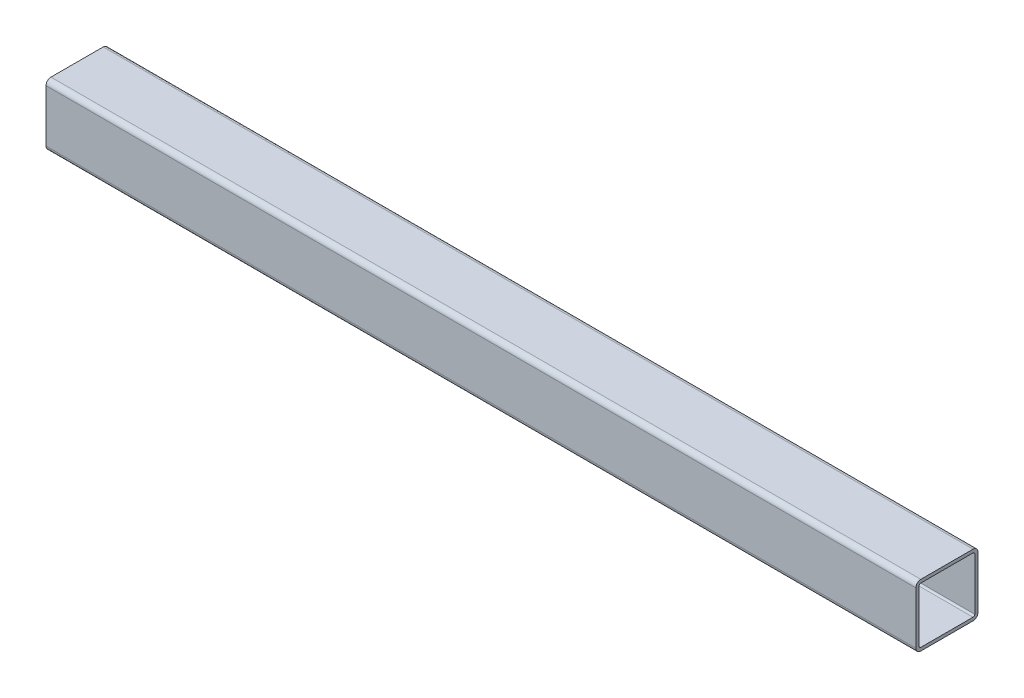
ISO-10303-21;
HEADER;
FILE_DESCRIPTION(('STEP AP214'),'2;1');
FILE_NAME('part.step','',(''),(''),'','','');
FILE_SCHEMA(('AUTOMOTIVE_DESIGN { 1 0 10303 214 1 1 1 1 }'));
ENDSEC;
DATA;
#1=APPLICATION_CONTEXT('core data for automotive mechanical design processes');
#2=APPLICATION_PROTOCOL_DEFINITION('international standard','automotive_design',2000,#1);
#3=PRODUCT_CONTEXT('',#1,'mechanical');
#4=PRODUCT('Part','Part','',(#3));
#5=PRODUCT_RELATED_PRODUCT_CATEGORY('part','',(#4));
#6=PRODUCT_DEFINITION_FORMATION('','',#4);
#7=PRODUCT_DEFINITION_CONTEXT('part definition',#1,'design');
#8=PRODUCT_DEFINITION('design','',#6,#7);
#9=PRODUCT_DEFINITION_SHAPE('','',#8);
#10=(LENGTH_UNIT() NAMED_UNIT(*) SI_UNIT(.MILLI.,.METRE.));
#11=(NAMED_UNIT(*) PLANE_ANGLE_UNIT() SI_UNIT($,.RADIAN.));
#12=(NAMED_UNIT(*) SI_UNIT($,.STERADIAN.) SOLID_ANGLE_UNIT());
#13=UNCERTAINTY_MEASURE_WITH_UNIT(LENGTH_MEASURE(1.E-05),#10,'distance_accuracy_value','');
#14=(GEOMETRIC_REPRESENTATION_CONTEXT(3) GLOBAL_UNCERTAINTY_ASSIGNED_CONTEXT((#13)) GLOBAL_UNIT_ASSIGNED_CONTEXT((#10,
#11,#12)) REPRESENTATION_CONTEXT('',''));
#15=CARTESIAN_POINT('',(0.,0.,0.));
#16=DIRECTION('',(0.,0.,1.));
#17=DIRECTION('',(1.,0.,0.));
#18=AXIS2_PLACEMENT_3D('',#15,#16,#17);
#19=CARTESIAN_POINT('',(177.8,10.541,21.209));
#20=DIRECTION('',(1.,0.,0.));
#21=DIRECTION('',(0.,0.,-1.));
#22=AXIS2_PLACEMENT_3D('',#19,#20,#21);
#23=PLANE('',#22);
#24=CARTESIAN_POINT('',(177.8,10.541,21.209));
#25=DIRECTION('',(1.,0.,0.));
#26=DIRECTION('',(0.,1.,0.));
#27=AXIS2_PLACEMENT_3D('',#24,#25,#26);
#28=CIRCLE('',#27,1.016);
#29=CARTESIAN_POINT('',(177.8,10.541,22.225));
#30=VERTEX_POINT('',#29);
#31=CARTESIAN_POINT('',(177.8,9.525,21.209));
#32=VERTEX_POINT('',#31);
#33=EDGE_CURVE('E260',#30,#32,#28,.T.);
#34=ORIENTED_EDGE('',*,*,#33,.T.);
#35=DIRECTION('',(0.,0.,-1.));
#36=VECTOR('',#35,1.);
#37=CARTESIAN_POINT('',(177.8,9.525,21.209));
#38=LINE('',#37,#36);
#39=CARTESIAN_POINT('',(177.8,9.525,10.541));
#40=VERTEX_POINT('',#39);
#41=EDGE_CURVE('E474',#32,#40,#38,.T.);
#42=ORIENTED_EDGE('',*,*,#41,.T.);
#43=CARTESIAN_POINT('',(177.8,10.541,10.541));
#44=DIRECTION('',(1.,0.,0.));
#45=DIRECTION('',(0.,0.,-1.));
#46=AXIS2_PLACEMENT_3D('',#43,#44,#45);
#47=CIRCLE('',#46,1.016);
#48=CARTESIAN_POINT('',(177.8,10.541,9.525));
#49=VERTEX_POINT('',#48);
#50=EDGE_CURVE('E161',#40,#49,#47,.T.);
#51=ORIENTED_EDGE('',*,*,#50,.T.);
#52=DIRECTION('',(0.,1.,0.));
#53=VECTOR('',#52,1.);
#54=CARTESIAN_POINT('',(177.8,10.541,9.525));
#55=LINE('',#54,#53);
#56=CARTESIAN_POINT('',(177.8,21.209,9.525));
#57=VERTEX_POINT('',#56);
#58=EDGE_CURVE('E460',#49,#57,#55,.T.);
#59=ORIENTED_EDGE('',*,*,#58,.T.);
#60=CARTESIAN_POINT('',(177.8,21.209,10.541));
#61=DIRECTION('',(1.,0.,0.));
#62=DIRECTION('',(0.,0.,-1.));
#63=AXIS2_PLACEMENT_3D('',#60,#61,#62);
#64=CIRCLE('',#63,1.016);
#65=CARTESIAN_POINT('',(177.8,22.225,10.541));
#66=VERTEX_POINT('',#65);
#67=EDGE_CURVE('E469',#57,#66,#64,.T.);
#68=ORIENTED_EDGE('',*,*,#67,.T.);
#69=DIRECTION('',(0.,0.,1.));
#70=VECTOR('',#69,1.);
#71=CARTESIAN_POINT('',(177.8,22.225,10.541));
#72=LINE('',#71,#70);
#73=CARTESIAN_POINT('',(177.8,22.225,21.209));
#74=VERTEX_POINT('',#73);
#75=EDGE_CURVE('E276',#66,#74,#72,.T.);
#76=ORIENTED_EDGE('',*,*,#75,.T.);
#77=CARTESIAN_POINT('',(177.8,21.209,21.209));
#78=DIRECTION('',(1.,0.,0.));
#79=DIRECTION('',(0.,0.,-1.));
#80=AXIS2_PLACEMENT_3D('',#77,#78,#79);
#81=CIRCLE('',#80,1.01599999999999);
#82=CARTESIAN_POINT('',(177.8,21.209,22.225));
#83=VERTEX_POINT('',#82);
#84=EDGE_CURVE('E293',#74,#83,#81,.T.);
#85=ORIENTED_EDGE('',*,*,#84,.T.);
#86=DIRECTION('',(0.,-1.,0.));
#87=VECTOR('',#86,1.);
#88=CARTESIAN_POINT('',(177.8,21.209,22.225));
#89=LINE('',#88,#87);
#90=EDGE_CURVE('E257',#83,#30,#89,.T.);
#91=ORIENTED_EDGE('',*,*,#90,.T.);
#92=EDGE_LOOP('',(#34,#42,#51,#59,#68,#76,#85,#91));
#93=FACE_BOUND('',#92,.T.);
#94=DIRECTION('',(0.,1.,0.));
#95=VECTOR('',#94,1.);
#96=CARTESIAN_POINT('',(177.8,10.541,10.1854));
#97=LINE('',#96,#95);
#98=CARTESIAN_POINT('',(177.8,10.541,10.1854));
#99=VERTEX_POINT('',#98);
#100=CARTESIAN_POINT('',(177.8,21.209,10.1854));
#101=VERTEX_POINT('',#100);
#102=EDGE_CURVE('E253',#99,#101,#97,.T.);
#103=ORIENTED_EDGE('',*,*,#102,.F.);
#104=CARTESIAN_POINT('',(177.8,10.541,10.541));
#105=DIRECTION('',(1.,0.,0.));
#106=DIRECTION('',(0.,0.,-1.));
#107=AXIS2_PLACEMENT_3D('',#104,#105,#106);
#108=CIRCLE('',#107,0.355599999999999);
#109=CARTESIAN_POINT('',(177.8,10.1854,10.541));
#110=VERTEX_POINT('',#109);
#111=EDGE_CURVE('E100',#110,#99,#108,.T.);
#112=ORIENTED_EDGE('',*,*,#111,.F.);
#113=DIRECTION('',(0.,0.,-1.));
#114=VECTOR('',#113,1.);
#115=CARTESIAN_POINT('',(177.8,10.1854,21.209));
#116=LINE('',#115,#114);
#117=CARTESIAN_POINT('',(177.8,10.1854,21.209));
#118=VERTEX_POINT('',#117);
#119=EDGE_CURVE('E212',#118,#110,#116,.T.);
#120=ORIENTED_EDGE('',*,*,#119,.F.);
#121=CARTESIAN_POINT('',(177.8,10.541,21.209));
#122=DIRECTION('',(1.,1.33244463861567E-13,-1.33244463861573E-13));
#123=DIRECTION('',(-1.33244463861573E-13,0.,-1.));
#124=AXIS2_PLACEMENT_3D('',#121,#122,#123);
#125=CIRCLE('',#124,0.3556);
#126=CARTESIAN_POINT('',(177.8,10.541,21.5646));
#127=VERTEX_POINT('',#126);
#128=EDGE_CURVE('E243',#127,#118,#125,.T.);
#129=ORIENTED_EDGE('',*,*,#128,.F.);
#130=DIRECTION('',(0.,-1.,0.));
#131=VECTOR('',#130,1.);
#132=CARTESIAN_POINT('',(177.8,21.209,21.5646));
#133=LINE('',#132,#131);
#134=CARTESIAN_POINT('',(177.8,21.209,21.5646));
#135=VERTEX_POINT('',#134);
#136=EDGE_CURVE('E229',#135,#127,#133,.T.);
#137=ORIENTED_EDGE('',*,*,#136,.F.);
#138=CARTESIAN_POINT('',(177.8,21.209,21.209));
#139=DIRECTION('',(1.,0.,0.));
#140=DIRECTION('',(0.,0.,-1.));
#141=AXIS2_PLACEMENT_3D('',#138,#139,#140);
#142=CIRCLE('',#141,0.355599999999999);
#143=CARTESIAN_POINT('',(177.8,21.5646,21.209));
#144=VERTEX_POINT('',#143);
#145=EDGE_CURVE('E238',#144,#135,#142,.T.);
#146=ORIENTED_EDGE('',*,*,#145,.F.);
#147=DIRECTION('',(0.,0.,1.));
#148=VECTOR('',#147,1.);
#149=CARTESIAN_POINT('',(177.8,21.5646,10.541));
#150=LINE('',#149,#148);
#151=CARTESIAN_POINT('',(177.8,21.5646,10.541));
#152=VERTEX_POINT('',#151);
#153=EDGE_CURVE('E246',#152,#144,#150,.T.);
#154=ORIENTED_EDGE('',*,*,#153,.F.);
#155=CARTESIAN_POINT('',(177.8,21.209,10.541));
#156=DIRECTION('',(1.,0.,0.));
#157=DIRECTION('',(0.,0.,-1.));
#158=AXIS2_PLACEMENT_3D('',#155,#156,#157);
#159=CIRCLE('',#158,0.3556);
#160=EDGE_CURVE('E251',#101,#152,#159,.T.);
#161=ORIENTED_EDGE('',*,*,#160,.F.);
#162=EDGE_LOOP('',(#103,#112,#120,#129,#137,#146,#154,#161));
#163=FACE_BOUND('',#162,.T.);
#164=ADVANCED_FACE('F41',(#93,#163),#23,.T.);
#165=CARTESIAN_POINT('',(0.,10.541,21.209));
#166=DIRECTION('',(1.,0.,0.));
#167=DIRECTION('',(0.,0.,-1.));
#168=AXIS2_PLACEMENT_3D('',#165,#166,#167);
#169=PLANE('',#168);
#170=CARTESIAN_POINT('',(0.,10.541,21.209));
#171=DIRECTION('',(1.,0.,0.));
#172=DIRECTION('',(0.,0.,-1.));
#173=AXIS2_PLACEMENT_3D('',#170,#171,#172);
#174=CIRCLE('',#173,1.016);
#175=CARTESIAN_POINT('',(0.,10.541,22.225));
#176=VERTEX_POINT('',#175);
#177=CARTESIAN_POINT('',(0.,9.525,21.209));
#178=VERTEX_POINT('',#177);
#179=EDGE_CURVE('E154',#176,#178,#174,.T.);
#180=ORIENTED_EDGE('',*,*,#179,.F.);
#181=DIRECTION('',(0.,-1.,0.));
#182=VECTOR('',#181,1.);
#183=CARTESIAN_POINT('',(0.,21.209,22.225));
#184=LINE('',#183,#182);
#185=CARTESIAN_POINT('',(0.,21.209,22.225));
#186=VERTEX_POINT('',#185);
#187=EDGE_CURVE('E258',#186,#176,#184,.T.);
#188=ORIENTED_EDGE('',*,*,#187,.F.);
#189=CARTESIAN_POINT('',(0.,21.209,21.209));
#190=DIRECTION('',(1.,0.,0.));
#191=DIRECTION('',(0.,0.,-1.));
#192=AXIS2_PLACEMENT_3D('',#189,#190,#191);
#193=CIRCLE('',#192,1.01599999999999);
#194=CARTESIAN_POINT('',(0.,22.225,21.209));
#195=VERTEX_POINT('',#194);
#196=EDGE_CURVE('E261',#195,#186,#193,.T.);
#197=ORIENTED_EDGE('',*,*,#196,.F.);
#198=DIRECTION('',(0.,0.,1.));
#199=VECTOR('',#198,1.);
#200=CARTESIAN_POINT('',(0.,22.225,10.541));
#201=LINE('',#200,#199);
#202=CARTESIAN_POINT('',(0.,22.225,10.541));
#203=VERTEX_POINT('',#202);
#204=EDGE_CURVE('E263',#203,#195,#201,.T.);
#205=ORIENTED_EDGE('',*,*,#204,.F.);
#206=CARTESIAN_POINT('',(0.,21.209,10.541));
#207=DIRECTION('',(1.,0.,0.));
#208=DIRECTION('',(0.,0.,-1.));
#209=AXIS2_PLACEMENT_3D('',#206,#207,#208);
#210=CIRCLE('',#209,1.016);
#211=CARTESIAN_POINT('',(0.,21.209,9.525));
#212=VERTEX_POINT('',#211);
#213=EDGE_CURVE('E170',#212,#203,#210,.T.);
#214=ORIENTED_EDGE('',*,*,#213,.F.);
#215=DIRECTION('',(0.,1.,0.));
#216=VECTOR('',#215,1.);
#217=CARTESIAN_POINT('',(0.,10.541,9.525));
#218=LINE('',#217,#216);
#219=CARTESIAN_POINT('',(0.,10.541,9.525));
#220=VERTEX_POINT('',#219);
#221=EDGE_CURVE('E168',#220,#212,#218,.T.);
#222=ORIENTED_EDGE('',*,*,#221,.F.);
#223=CARTESIAN_POINT('',(0.,10.541,10.541));
#224=DIRECTION('',(1.,0.,0.));
#225=DIRECTION('',(0.,0.,-1.));
#226=AXIS2_PLACEMENT_3D('',#223,#224,#225);
#227=CIRCLE('',#226,1.016);
#228=CARTESIAN_POINT('',(0.,9.525,10.541));
#229=VERTEX_POINT('',#228);
#230=EDGE_CURVE('E153',#229,#220,#227,.T.);
#231=ORIENTED_EDGE('',*,*,#230,.F.);
#232=DIRECTION('',(0.,0.,-1.));
#233=VECTOR('',#232,1.);
#234=CARTESIAN_POINT('',(0.,9.525,21.209));
#235=LINE('',#234,#233);
#236=EDGE_CURVE('E143',#178,#229,#235,.T.);
#237=ORIENTED_EDGE('',*,*,#236,.F.);
#238=EDGE_LOOP('',(#180,#188,#197,#205,#214,#222,#231,#237));
#239=FACE_BOUND('',#238,.T.);
#240=CARTESIAN_POINT('',(0.,10.541,10.541));
#241=DIRECTION('',(1.,0.,0.));
#242=DIRECTION('',(0.,0.,-1.));
#243=AXIS2_PLACEMENT_3D('',#240,#241,#242);
#244=CIRCLE('',#243,0.355599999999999);
#245=CARTESIAN_POINT('',(0.,10.1854,10.541));
#246=VERTEX_POINT('',#245);
#247=CARTESIAN_POINT('',(0.,10.541,10.1854));
#248=VERTEX_POINT('',#247);
#249=EDGE_CURVE('E66',#246,#248,#244,.T.);
#250=ORIENTED_EDGE('',*,*,#249,.T.);
#251=DIRECTION('',(0.,1.,0.));
#252=VECTOR('',#251,1.);
#253=CARTESIAN_POINT('',(0.,10.541,10.1854));
#254=LINE('',#253,#252);
#255=CARTESIAN_POINT('',(0.,21.209,10.1854));
#256=VERTEX_POINT('',#255);
#257=EDGE_CURVE('E175',#248,#256,#254,.T.);
#258=ORIENTED_EDGE('',*,*,#257,.T.);
#259=CARTESIAN_POINT('',(0.,21.209,10.541));
#260=DIRECTION('',(1.,0.,0.));
#261=DIRECTION('',(0.,0.,-1.));
#262=AXIS2_PLACEMENT_3D('',#259,#260,#261);
#263=CIRCLE('',#262,0.3556);
#264=CARTESIAN_POINT('',(0.,21.5646,10.541));
#265=VERTEX_POINT('',#264);
#266=EDGE_CURVE('E178',#256,#265,#263,.T.);
#267=ORIENTED_EDGE('',*,*,#266,.T.);
#268=DIRECTION('',(0.,0.,1.));
#269=VECTOR('',#268,1.);
#270=CARTESIAN_POINT('',(0.,21.5646,10.541));
#271=LINE('',#270,#269);
#272=CARTESIAN_POINT('',(0.,21.5646,21.209));
#273=VERTEX_POINT('',#272);
#274=EDGE_CURVE('E181',#265,#273,#271,.T.);
#275=ORIENTED_EDGE('',*,*,#274,.T.);
#276=CARTESIAN_POINT('',(0.,21.209,21.209));
#277=DIRECTION('',(1.,0.,0.));
#278=DIRECTION('',(0.,0.,-1.));
#279=AXIS2_PLACEMENT_3D('',#276,#277,#278);
#280=CIRCLE('',#279,0.355599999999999);
#281=CARTESIAN_POINT('',(0.,21.209,21.5646));
#282=VERTEX_POINT('',#281);
#283=EDGE_CURVE('E184',#273,#282,#280,.T.);
#284=ORIENTED_EDGE('',*,*,#283,.T.);
#285=DIRECTION('',(0.,-1.,0.));
#286=VECTOR('',#285,1.);
#287=CARTESIAN_POINT('',(0.,21.209,21.5646));
#288=LINE('',#287,#286);
#289=CARTESIAN_POINT('',(0.,10.541,21.5646));
#290=VERTEX_POINT('',#289);
#291=EDGE_CURVE('E187',#282,#290,#288,.T.);
#292=ORIENTED_EDGE('',*,*,#291,.T.);
#293=CARTESIAN_POINT('',(0.,10.541,21.209));
#294=DIRECTION('',(1.,0.,0.));
#295=DIRECTION('',(0.,0.,-1.));
#296=AXIS2_PLACEMENT_3D('',#293,#294,#295);
#297=CIRCLE('',#296,0.3556);
#298=CARTESIAN_POINT('',(0.,10.1854,21.209));
#299=VERTEX_POINT('',#298);
#300=EDGE_CURVE('E190',#290,#299,#297,.T.);
#301=ORIENTED_EDGE('',*,*,#300,.T.);
#302=DIRECTION('',(0.,0.,-1.));
#303=VECTOR('',#302,1.);
#304=CARTESIAN_POINT('',(0.,10.1854,21.209));
#305=LINE('',#304,#303);
#306=EDGE_CURVE('E193',#299,#246,#305,.T.);
#307=ORIENTED_EDGE('',*,*,#306,.T.);
#308=EDGE_LOOP('',(#250,#258,#267,#275,#284,#292,#301,#307));
#309=FACE_BOUND('',#308,.T.);
#310=ADVANCED_FACE('F165',(#239,#309),#169,.F.);
#311=CARTESIAN_POINT('',(177.8,10.541,21.209));
#312=DIRECTION('',(-1.,0.,0.));
#313=DIRECTION('',(0.,0.,1.));
#314=AXIS2_PLACEMENT_3D('',#311,#312,#313);
#315=CYLINDRICAL_SURFACE('',#314,1.016);
#316=ORIENTED_EDGE('',*,*,#179,.T.);
#317=DIRECTION('',(-1.,0.,0.));
#318=VECTOR('',#317,1.);
#319=CARTESIAN_POINT('',(177.8,9.525,21.209));
#320=LINE('',#319,#318);
#321=EDGE_CURVE('E11',#32,#178,#320,.T.);
#322=ORIENTED_EDGE('',*,*,#321,.F.);
#323=ORIENTED_EDGE('',*,*,#33,.F.);
#324=DIRECTION('',(-1.,0.,0.));
#325=VECTOR('',#324,1.);
#326=CARTESIAN_POINT('',(177.8,10.541,22.225));
#327=LINE('',#326,#325);
#328=EDGE_CURVE('E209',#30,#176,#327,.T.);
#329=ORIENTED_EDGE('',*,*,#328,.T.);
#330=EDGE_LOOP('',(#316,#322,#323,#329));
#331=FACE_BOUND('',#330,.T.);
#332=ADVANCED_FACE('F323',(#331),#315,.T.);
#333=CARTESIAN_POINT('',(177.8,9.525,21.209));
#334=DIRECTION('',(0.,1.,0.));
#335=DIRECTION('',(0.,0.,1.));
#336=AXIS2_PLACEMENT_3D('',#333,#334,#335);
#337=PLANE('',#336);
#338=ORIENTED_EDGE('',*,*,#236,.T.);
#339=DIRECTION('',(-1.,0.,0.));
#340=VECTOR('',#339,1.);
#341=CARTESIAN_POINT('',(177.8,9.525,10.541));
#342=LINE('',#341,#340);
#343=EDGE_CURVE('E50',#40,#229,#342,.T.);
#344=ORIENTED_EDGE('',*,*,#343,.F.);
#345=ORIENTED_EDGE('',*,*,#41,.F.);
#346=ORIENTED_EDGE('',*,*,#321,.T.);
#347=EDGE_LOOP('',(#338,#344,#345,#346));
#348=FACE_BOUND('',#347,.T.);
#349=ADVANCED_FACE('F147',(#348),#337,.F.);
#350=CARTESIAN_POINT('',(177.8,10.541,10.541));
#351=DIRECTION('',(-1.,0.,0.));
#352=DIRECTION('',(0.,0.,1.));
#353=AXIS2_PLACEMENT_3D('',#350,#351,#352);
#354=CYLINDRICAL_SURFACE('',#353,1.016);
#355=ORIENTED_EDGE('',*,*,#230,.T.);
#356=DIRECTION('',(-1.,0.,0.));
#357=VECTOR('',#356,1.);
#358=CARTESIAN_POINT('',(177.8,10.541,9.525));
#359=LINE('',#358,#357);
#360=EDGE_CURVE('E162',#49,#220,#359,.T.);
#361=ORIENTED_EDGE('',*,*,#360,.F.);
#362=ORIENTED_EDGE('',*,*,#50,.F.);
#363=ORIENTED_EDGE('',*,*,#343,.T.);
#364=EDGE_LOOP('',(#355,#361,#362,#363));
#365=FACE_BOUND('',#364,.T.);
#366=ADVANCED_FACE('F157',(#365),#354,.T.);
#367=CARTESIAN_POINT('',(177.8,10.541,9.525));
#368=DIRECTION('',(0.,0.,1.));
#369=DIRECTION('',(1.,0.,0.));
#370=AXIS2_PLACEMENT_3D('',#367,#368,#369);
#371=PLANE('',#370);
#372=ORIENTED_EDGE('',*,*,#221,.T.);
#373=DIRECTION('',(-1.,0.,0.));
#374=VECTOR('',#373,1.);
#375=CARTESIAN_POINT('',(177.8,21.209,9.525));
#376=LINE('',#375,#374);
#377=EDGE_CURVE('E197',#57,#212,#376,.T.);
#378=ORIENTED_EDGE('',*,*,#377,.F.);
#379=ORIENTED_EDGE('',*,*,#58,.F.);
#380=ORIENTED_EDGE('',*,*,#360,.T.);
#381=EDGE_LOOP('',(#372,#378,#379,#380));
#382=FACE_BOUND('',#381,.T.);
#383=ADVANCED_FACE('F333',(#382),#371,.F.);
#384=CARTESIAN_POINT('',(177.8,21.209,10.541));
#385=DIRECTION('',(-1.,0.,0.));
#386=DIRECTION('',(0.,0.,1.));
#387=AXIS2_PLACEMENT_3D('',#384,#385,#386);
#388=CYLINDRICAL_SURFACE('',#387,1.016);
#389=ORIENTED_EDGE('',*,*,#213,.T.);
#390=DIRECTION('',(-1.,0.,0.));
#391=VECTOR('',#390,1.);
#392=CARTESIAN_POINT('',(177.8,22.225,10.541));
#393=LINE('',#392,#391);
#394=EDGE_CURVE('E200',#66,#203,#393,.T.);
#395=ORIENTED_EDGE('',*,*,#394,.F.);
#396=ORIENTED_EDGE('',*,*,#67,.F.);
#397=ORIENTED_EDGE('',*,*,#377,.T.);
#398=EDGE_LOOP('',(#389,#395,#396,#397));
#399=FACE_BOUND('',#398,.T.);
#400=ADVANCED_FACE('F266',(#399),#388,.T.);
#401=CARTESIAN_POINT('',(177.8,22.225,10.541));
#402=DIRECTION('',(0.,-1.,0.));
#403=DIRECTION('',(0.,0.,-1.));
#404=AXIS2_PLACEMENT_3D('',#401,#402,#403);
#405=PLANE('',#404);
#406=ORIENTED_EDGE('',*,*,#204,.T.);
#407=DIRECTION('',(-1.,0.,0.));
#408=VECTOR('',#407,1.);
#409=CARTESIAN_POINT('',(177.8,22.225,21.209));
#410=LINE('',#409,#408);
#411=EDGE_CURVE('E203',#74,#195,#410,.T.);
#412=ORIENTED_EDGE('',*,*,#411,.F.);
#413=ORIENTED_EDGE('',*,*,#75,.F.);
#414=ORIENTED_EDGE('',*,*,#394,.T.);
#415=EDGE_LOOP('',(#406,#412,#413,#414));
#416=FACE_BOUND('',#415,.T.);
#417=ADVANCED_FACE('F273',(#416),#405,.F.);
#418=CARTESIAN_POINT('',(177.8,21.209,21.209));
#419=DIRECTION('',(-1.,0.,0.));
#420=DIRECTION('',(0.,0.,1.));
#421=AXIS2_PLACEMENT_3D('',#418,#419,#420);
#422=CYLINDRICAL_SURFACE('',#421,1.016);
#423=ORIENTED_EDGE('',*,*,#196,.T.);
#424=DIRECTION('',(-1.,0.,0.));
#425=VECTOR('',#424,1.);
#426=CARTESIAN_POINT('',(177.8,21.209,22.225));
#427=LINE('',#426,#425);
#428=EDGE_CURVE('E206',#83,#186,#427,.T.);
#429=ORIENTED_EDGE('',*,*,#428,.F.);
#430=ORIENTED_EDGE('',*,*,#84,.F.);
#431=ORIENTED_EDGE('',*,*,#411,.T.);
#432=EDGE_LOOP('',(#423,#429,#430,#431));
#433=FACE_BOUND('',#432,.T.);
#434=ADVANCED_FACE('F281',(#433),#422,.T.);
#435=CARTESIAN_POINT('',(177.8,21.209,22.225));
#436=DIRECTION('',(0.,0.,-1.));
#437=DIRECTION('',(0.,1.,0.));
#438=AXIS2_PLACEMENT_3D('',#435,#436,#437);
#439=PLANE('',#438);
#440=ORIENTED_EDGE('',*,*,#187,.T.);
#441=ORIENTED_EDGE('',*,*,#328,.F.);
#442=ORIENTED_EDGE('',*,*,#90,.F.);
#443=ORIENTED_EDGE('',*,*,#428,.T.);
#444=EDGE_LOOP('',(#440,#441,#442,#443));
#445=FACE_BOUND('',#444,.T.);
#446=ADVANCED_FACE('F285',(#445),#439,.F.);
#447=CARTESIAN_POINT('',(177.8,10.541,10.541));
#448=DIRECTION('',(-1.,0.,0.));
#449=DIRECTION('',(0.,0.,1.));
#450=AXIS2_PLACEMENT_3D('',#447,#448,#449);
#451=CYLINDRICAL_SURFACE('',#450,0.3556);
#452=ORIENTED_EDGE('',*,*,#249,.F.);
#453=DIRECTION('',(-1.,0.,0.));
#454=VECTOR('',#453,1.);
#455=CARTESIAN_POINT('',(177.8,10.1854,10.541));
#456=LINE('',#455,#454);
#457=EDGE_CURVE('E210',#110,#246,#456,.T.);
#458=ORIENTED_EDGE('',*,*,#457,.F.);
#459=ORIENTED_EDGE('',*,*,#111,.T.);
#460=DIRECTION('',(-1.,0.,0.));
#461=VECTOR('',#460,1.);
#462=CARTESIAN_POINT('',(177.8,10.541,10.1854));
#463=LINE('',#462,#461);
#464=EDGE_CURVE('E213',#99,#248,#463,.T.);
#465=ORIENTED_EDGE('',*,*,#464,.T.);
#466=EDGE_LOOP('',(#452,#458,#459,#465));
#467=FACE_BOUND('',#466,.T.);
#468=ADVANCED_FACE('F299',(#467),#451,.F.);
#469=CARTESIAN_POINT('',(177.8,10.541,10.1854));
#470=DIRECTION('',(0.,0.,1.));
#471=DIRECTION('',(1.,0.,0.));
#472=AXIS2_PLACEMENT_3D('',#469,#470,#471);
#473=PLANE('',#472);
#474=ORIENTED_EDGE('',*,*,#257,.F.);
#475=ORIENTED_EDGE('',*,*,#464,.F.);
#476=ORIENTED_EDGE('',*,*,#102,.T.);
#477=DIRECTION('',(-1.,0.,0.));
#478=VECTOR('',#477,1.);
#479=CARTESIAN_POINT('',(177.8,21.209,10.1854));
#480=LINE('',#479,#478);
#481=EDGE_CURVE('E215',#101,#256,#480,.T.);
#482=ORIENTED_EDGE('',*,*,#481,.T.);
#483=EDGE_LOOP('',(#474,#475,#476,#482));
#484=FACE_BOUND('',#483,.T.);
#485=ADVANCED_FACE('F303',(#484),#473,.T.);
#486=CARTESIAN_POINT('',(177.8,21.209,10.541));
#487=DIRECTION('',(-1.,0.,0.));
#488=DIRECTION('',(0.,0.,1.));
#489=AXIS2_PLACEMENT_3D('',#486,#487,#488);
#490=CYLINDRICAL_SURFACE('',#489,0.3556);
#491=ORIENTED_EDGE('',*,*,#266,.F.);
#492=ORIENTED_EDGE('',*,*,#481,.F.);
#493=ORIENTED_EDGE('',*,*,#160,.T.);
#494=DIRECTION('',(-1.,0.,0.));
#495=VECTOR('',#494,1.);
#496=CARTESIAN_POINT('',(177.8,21.5646,10.541));
#497=LINE('',#496,#495);
#498=EDGE_CURVE('E217',#152,#265,#497,.T.);
#499=ORIENTED_EDGE('',*,*,#498,.T.);
#500=EDGE_LOOP('',(#491,#492,#493,#499));
#501=FACE_BOUND('',#500,.T.);
#502=ADVANCED_FACE('F306',(#501),#490,.F.);
#503=CARTESIAN_POINT('',(177.8,21.5646,10.541));
#504=DIRECTION('',(0.,-1.,0.));
#505=DIRECTION('',(0.,0.,-1.));
#506=AXIS2_PLACEMENT_3D('',#503,#504,#505);
#507=PLANE('',#506);
#508=ORIENTED_EDGE('',*,*,#274,.F.);
#509=ORIENTED_EDGE('',*,*,#498,.F.);
#510=ORIENTED_EDGE('',*,*,#153,.T.);
#511=DIRECTION('',(-1.,0.,0.));
#512=VECTOR('',#511,1.);
#513=CARTESIAN_POINT('',(177.8,21.5646,21.209));
#514=LINE('',#513,#512);
#515=EDGE_CURVE('E219',#144,#273,#514,.T.);
#516=ORIENTED_EDGE('',*,*,#515,.T.);
#517=EDGE_LOOP('',(#508,#509,#510,#516));
#518=FACE_BOUND('',#517,.T.);
#519=ADVANCED_FACE('F309',(#518),#507,.T.);
#520=CARTESIAN_POINT('',(177.8,21.209,21.209));
#521=DIRECTION('',(-1.,0.,0.));
#522=DIRECTION('',(0.,0.,1.));
#523=AXIS2_PLACEMENT_3D('',#520,#521,#522);
#524=CYLINDRICAL_SURFACE('',#523,0.355600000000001);
#525=ORIENTED_EDGE('',*,*,#283,.F.);
#526=ORIENTED_EDGE('',*,*,#515,.F.);
#527=ORIENTED_EDGE('',*,*,#145,.T.);
#528=DIRECTION('',(-1.,0.,0.));
#529=VECTOR('',#528,1.);
#530=CARTESIAN_POINT('',(177.8,21.209,21.5646));
#531=LINE('',#530,#529);
#532=EDGE_CURVE('E221',#135,#282,#531,.T.);
#533=ORIENTED_EDGE('',*,*,#532,.T.);
#534=EDGE_LOOP('',(#525,#526,#527,#533));
#535=FACE_BOUND('',#534,.T.);
#536=ADVANCED_FACE('F236',(#535),#524,.F.);
#537=CARTESIAN_POINT('',(177.8,21.209,21.5646));
#538=DIRECTION('',(0.,0.,-1.));
#539=DIRECTION('',(-1.,0.,0.));
#540=AXIS2_PLACEMENT_3D('',#537,#538,#539);
#541=PLANE('',#540);
#542=ORIENTED_EDGE('',*,*,#291,.F.);
#543=ORIENTED_EDGE('',*,*,#532,.F.);
#544=ORIENTED_EDGE('',*,*,#136,.T.);
#545=DIRECTION('',(-1.,0.,0.));
#546=VECTOR('',#545,1.);
#547=CARTESIAN_POINT('',(177.8,10.541,21.5646));
#548=LINE('',#547,#546);
#549=EDGE_CURVE('E222',#127,#290,#548,.T.);
#550=ORIENTED_EDGE('',*,*,#549,.T.);
#551=EDGE_LOOP('',(#542,#543,#544,#550));
#552=FACE_BOUND('',#551,.T.);
#553=ADVANCED_FACE('F226',(#552),#541,.T.);
#554=CARTESIAN_POINT('',(177.8,10.541,21.209));
#555=DIRECTION('',(-1.,0.,0.));
#556=DIRECTION('',(0.,0.,1.));
#557=AXIS2_PLACEMENT_3D('',#554,#555,#556);
#558=CYLINDRICAL_SURFACE('',#557,0.355600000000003);
#559=ORIENTED_EDGE('',*,*,#300,.F.);
#560=ORIENTED_EDGE('',*,*,#549,.F.);
#561=ORIENTED_EDGE('',*,*,#128,.T.);
#562=DIRECTION('',(-1.,0.,0.));
#563=VECTOR('',#562,1.);
#564=CARTESIAN_POINT('',(177.8,10.1854,21.209));
#565=LINE('',#564,#563);
#566=EDGE_CURVE('E45',#118,#299,#565,.T.);
#567=ORIENTED_EDGE('',*,*,#566,.T.);
#568=EDGE_LOOP('',(#559,#560,#561,#567));
#569=FACE_BOUND('',#568,.T.);
#570=ADVANCED_FACE('F231',(#569),#558,.F.);
#571=CARTESIAN_POINT('',(177.8,10.1854,21.209));
#572=DIRECTION('',(0.,1.,0.));
#573=DIRECTION('',(0.,0.,1.));
#574=AXIS2_PLACEMENT_3D('',#571,#572,#573);
#575=PLANE('',#574);
#576=ORIENTED_EDGE('',*,*,#306,.F.);
#577=ORIENTED_EDGE('',*,*,#566,.F.);
#578=ORIENTED_EDGE('',*,*,#119,.T.);
#579=ORIENTED_EDGE('',*,*,#457,.T.);
#580=EDGE_LOOP('',(#576,#577,#578,#579));
#581=FACE_BOUND('',#580,.T.);
#582=ADVANCED_FACE('F43',(#581),#575,.T.);
#583=CLOSED_SHELL('',(#164,#310,#332,#349,#366,#383,#400,#417,#434,#446,#468,#485,#502,#519,
#536,#553,#570,#582));
#584=MANIFOLD_SOLID_BREP('B2',#583);
#585=ADVANCED_BREP_SHAPE_REPRESENTATION('',(#18,#584),#14);
#586=SHAPE_DEFINITION_REPRESENTATION(#9,#585);
ENDSEC;
END-ISO-10303-21;
